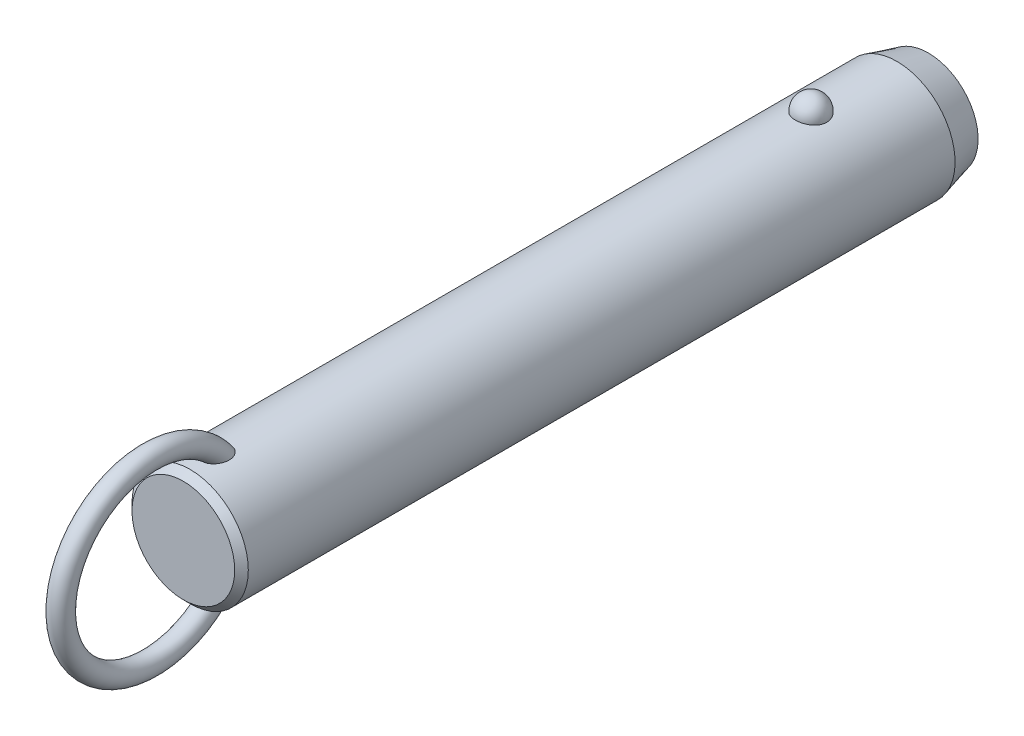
ISO-10303-21;
HEADER;
FILE_DESCRIPTION(('STEP AP214'),'2;1');
FILE_NAME('part.step','',(''),(''),'','','');
FILE_SCHEMA(('AUTOMOTIVE_DESIGN { 1 0 10303 214 1 1 1 1 }'));
ENDSEC;
DATA;
#1=APPLICATION_CONTEXT('core data for automotive mechanical design processes');
#2=APPLICATION_PROTOCOL_DEFINITION('international standard','automotive_design',2000,#1);
#3=PRODUCT_CONTEXT('',#1,'mechanical');
#4=PRODUCT('Part','Part','',(#3));
#5=PRODUCT_RELATED_PRODUCT_CATEGORY('part','',(#4));
#6=PRODUCT_DEFINITION_FORMATION('','',#4);
#7=PRODUCT_DEFINITION_CONTEXT('part definition',#1,'design');
#8=PRODUCT_DEFINITION('design','',#6,#7);
#9=PRODUCT_DEFINITION_SHAPE('','',#8);
#10=(LENGTH_UNIT() NAMED_UNIT(*) SI_UNIT(.MILLI.,.METRE.));
#11=(NAMED_UNIT(*) PLANE_ANGLE_UNIT() SI_UNIT($,.RADIAN.));
#12=(NAMED_UNIT(*) SI_UNIT($,.STERADIAN.) SOLID_ANGLE_UNIT());
#13=UNCERTAINTY_MEASURE_WITH_UNIT(LENGTH_MEASURE(1.E-05),#10,'distance_accuracy_value','');
#14=(GEOMETRIC_REPRESENTATION_CONTEXT(3) GLOBAL_UNCERTAINTY_ASSIGNED_CONTEXT((#13)) GLOBAL_UNIT_ASSIGNED_CONTEXT((#10,
#11,#12)) REPRESENTATION_CONTEXT('',''));
#15=CARTESIAN_POINT('',(0.,0.,0.));
#16=DIRECTION('',(0.,0.,1.));
#17=DIRECTION('',(1.,0.,0.));
#18=AXIS2_PLACEMENT_3D('',#15,#16,#17);
#19=CARTESIAN_POINT('',(0.,0.,104.1));
#20=DIRECTION('',(0.,0.,-1.));
#21=DIRECTION('',(-1.,0.,0.));
#22=AXIS2_PLACEMENT_3D('',#19,#20,#21);
#23=CYLINDRICAL_SURFACE('',#22,11.1);
#24=CARTESIAN_POINT('',(2.9724815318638,10.6945945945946,-3.));
#25=CARTESIAN_POINT('',(2.9724783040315,10.6945972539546,-2.83225059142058));
#26=CARTESIAN_POINT('',(2.95876598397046,10.6984356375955,-2.66445972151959));
#27=CARTESIAN_POINT('',(2.90424529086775,10.7133624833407,-2.33362381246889));
#28=CARTESIAN_POINT('',(2.8634252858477,10.7244540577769,-2.1705808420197));
#29=CARTESIAN_POINT('',(2.75573657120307,10.7526272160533,-1.85396767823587));
#30=CARTESIAN_POINT('',(2.68887937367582,10.7697061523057,-1.70039333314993));
#31=CARTESIAN_POINT('',(2.53079696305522,10.8079438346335,-1.40691598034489));
#32=CARTESIAN_POINT('',(2.43957264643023,10.8291024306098,-1.2670124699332));
#33=CARTESIAN_POINT('',(2.23458150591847,10.8732541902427,-1.00409565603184));
#34=CARTESIAN_POINT('',(2.12071295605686,10.8962553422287,-0.881162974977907));
#35=CARTESIAN_POINT('',(1.87365402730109,10.9414421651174,-0.656352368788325));
#36=CARTESIAN_POINT('',(1.74046358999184,10.9636278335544,-0.554474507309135));
#37=CARTESIAN_POINT('',(1.45872188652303,11.0046495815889,-0.374872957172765));
#38=CARTESIAN_POINT('',(1.31021276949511,11.0234944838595,-0.297085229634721));
#39=CARTESIAN_POINT('',(1.00170030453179,11.0557957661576,-0.167529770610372));
#40=CARTESIAN_POINT('',(0.841698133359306,11.0692526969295,-0.115759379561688));
#41=CARTESIAN_POINT('',(0.517607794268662,11.0890932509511,-0.0403925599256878));
#42=CARTESIAN_POINT('',(0.353633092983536,11.0955916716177,-0.0163383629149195));
#43=CARTESIAN_POINT('',(0.0238420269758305,11.1011989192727,0.00445177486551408));
#44=CARTESIAN_POINT('',(-0.141974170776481,11.1003084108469,0.0011901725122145));
#45=CARTESIAN_POINT('',(-0.46840517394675,11.0912990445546,-0.0323233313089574));
#46=CARTESIAN_POINT('',(-0.629059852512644,11.0832767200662,-0.062214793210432));
#47=CARTESIAN_POINT('',(-0.942937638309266,11.0609962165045,-0.147645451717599));
#48=CARTESIAN_POINT('',(-1.09616062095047,11.0467379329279,-0.203185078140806));
#49=CARTESIAN_POINT('',(-1.39181061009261,11.0134071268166,-0.338752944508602));
#50=CARTESIAN_POINT('',(-1.53417383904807,10.9943086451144,-0.418913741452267));
#51=CARTESIAN_POINT('',(-1.80342160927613,10.9533667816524,-0.601448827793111));
#52=CARTESIAN_POINT('',(-1.9303046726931,10.9315231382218,-0.703825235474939));
#53=CARTESIAN_POINT('',(-2.16747598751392,10.887005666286,-0.930091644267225));
#54=CARTESIAN_POINT('',(-2.27742774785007,10.8643239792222,-1.05433291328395));
#55=CARTESIAN_POINT('',(-2.47517316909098,10.8209886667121,-1.31966633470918));
#56=CARTESIAN_POINT('',(-2.56296538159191,10.8003351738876,-1.46075958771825));
#57=CARTESIAN_POINT('',(-2.71500300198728,10.7631304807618,-1.75753646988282));
#58=CARTESIAN_POINT('',(-2.77898901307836,10.7466250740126,-1.91335887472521));
#59=CARTESIAN_POINT('',(-2.88046189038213,10.7198747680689,-2.2339152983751));
#60=CARTESIAN_POINT('',(-2.91794947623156,10.709629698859,-2.39864907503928));
#61=CARTESIAN_POINT('',(-2.96537819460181,10.6965949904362,-2.73165170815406));
#62=CARTESIAN_POINT('',(-2.97542891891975,10.693775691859,-2.89990378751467));
#63=CARTESIAN_POINT('',(-2.96804271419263,10.6958279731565,-3.235752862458));
#64=CARTESIAN_POINT('',(-2.95060646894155,10.7006993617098,-3.40334987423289));
#65=CARTESIAN_POINT('',(-2.88883358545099,10.71753912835,-3.73233906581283));
#66=CARTESIAN_POINT('',(-2.84462026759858,10.7294749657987,-3.89375610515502));
#67=CARTESIAN_POINT('',(-2.73050447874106,10.7590797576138,-4.20667949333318));
#68=CARTESIAN_POINT('',(-2.66060103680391,10.7767489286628,-4.35818546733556));
#69=CARTESIAN_POINT('',(-2.49642559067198,10.8159599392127,-4.6478542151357));
#70=CARTESIAN_POINT('',(-2.40203047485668,10.8375211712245,-4.78594458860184));
#71=CARTESIAN_POINT('',(-2.19143488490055,10.8820570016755,-5.0441038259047));
#72=CARTESIAN_POINT('',(-2.07523364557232,10.9050316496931,-5.16417205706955));
#73=CARTESIAN_POINT('',(-1.82361254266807,10.9499219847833,-5.38334833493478));
#74=CARTESIAN_POINT('',(-1.68812945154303,10.9718338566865,-5.4823846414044));
#75=CARTESIAN_POINT('',(-1.40191298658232,11.0120611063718,-5.65618873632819));
#76=CARTESIAN_POINT('',(-1.25118062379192,11.0303767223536,-5.73095813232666));
#77=CARTESIAN_POINT('',(-0.940570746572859,11.0611653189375,-5.85334725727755));
#78=CARTESIAN_POINT('',(-0.780821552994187,11.0737044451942,-5.90127578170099));
#79=CARTESIAN_POINT('',(-0.455204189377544,11.0918598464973,-5.96992976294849));
#80=CARTESIAN_POINT('',(-0.289336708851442,11.0974768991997,-5.99065827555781));
#81=CARTESIAN_POINT('',(0.0406846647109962,11.1011307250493,-6.00418773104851));
#82=CARTESIAN_POINT('',(0.204817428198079,11.099299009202,-5.99747318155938));
#83=CARTESIAN_POINT('',(0.529553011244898,11.088551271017,-5.9574031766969));
#84=CARTESIAN_POINT('',(0.690155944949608,11.0796354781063,-5.92404858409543));
#85=CARTESIAN_POINT('',(1.0027760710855,11.0557204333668,-5.83180084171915));
#86=CARTESIAN_POINT('',(1.15482001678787,11.0407414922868,-5.77299291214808));
#87=CARTESIAN_POINT('',(1.44678373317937,11.0062913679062,-5.63147366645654));
#88=CARTESIAN_POINT('',(1.58670279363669,10.9868199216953,-5.54876095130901));
#89=CARTESIAN_POINT('',(1.8527023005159,10.9451315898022,-5.36027644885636));
#90=CARTESIAN_POINT('',(1.97855158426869,10.9228788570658,-5.25418644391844));
#91=CARTESIAN_POINT('',(2.21080872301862,10.8782509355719,-5.02251354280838));
#92=CARTESIAN_POINT('',(2.31721312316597,10.8558757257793,-4.89692718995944));
#93=CARTESIAN_POINT('',(2.50945517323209,10.8130715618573,-4.62745408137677));
#94=CARTESIAN_POINT('',(2.59493284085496,10.7926798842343,-4.48330448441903));
#95=CARTESIAN_POINT('',(2.740862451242,10.7565495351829,-4.18236358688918));
#96=CARTESIAN_POINT('',(2.80132490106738,10.7408089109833,-4.02557762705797));
#97=CARTESIAN_POINT('',(2.88959070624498,10.7173718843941,-3.72475308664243));
#98=CARTESIAN_POINT('',(2.92062102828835,10.7088950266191,-3.58171216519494));
#99=CARTESIAN_POINT('',(2.96206765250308,10.6975052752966,-3.29245795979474));
#100=CARTESIAN_POINT('',(2.97248434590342,10.6945922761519,-3.14624473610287));
#101=CARTESIAN_POINT('',(2.9724815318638,10.6945945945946,-3.));
#102=B_SPLINE_CURVE_WITH_KNOTS('',3,(#24,#25,#26,#27,#28,#29,#30,#31,#32,#33,#34,#35,#36,#37,
#38,#39,#40,#41,#42,#43,#44,#45,#46,#47,#48,#49,#50,#51,#52,#53,#54,#55,#56,#57,#58,#59,#60,#61,
#62,#63,#64,#65,#66,#67,#68,#69,#70,#71,#72,#73,#74,#75,#76,#77,#78,#79,#80,#81,#82,#83,#84,#85,
#86,#87,#88,#89,#90,#91,#92,#93,#94,#95,#96,#97,#98,#99,#100,#101),.UNSPECIFIED.,.T.,.F.,(4,2,2,
2,2,2,2,2,2,2,2,2,2,2,2,2,2,2,2,2,2,2,2,2,2,2,2,2,2,2,2,2,2,2,2,2,2,2,4),(0.,0.502722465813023,
1.00566079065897,1.5083769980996,2.01107471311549,2.51608392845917,3.02109467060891,
3.52475118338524,4.02835620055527,4.52351860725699,5.01863647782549,5.50715297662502,
5.99567766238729,6.48688002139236,6.97812923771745,7.47814366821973,7.97819077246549,
8.48353712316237,8.98886974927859,9.49218093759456,9.99547960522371,10.4964777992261,
10.997494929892,11.5010810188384,12.0046847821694,12.5099796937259,13.0152411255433,
13.5145635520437,14.0138298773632,14.5043200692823,14.9947943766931,15.4836390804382,
15.9725123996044,16.4685040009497,16.9645836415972,17.4686765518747,17.972557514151,
18.410841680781,18.849117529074),.UNSPECIFIED.);
#103=CARTESIAN_POINT('',(2.9724815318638,10.6945945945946,-3.));
#104=VERTEX_POINT('',#103);
#105=EDGE_CURVE('E41',#104,#104,#102,.T.);
#106=ORIENTED_EDGE('',*,*,#105,.T.);
#107=EDGE_LOOP('',(#106));
#108=FACE_BOUND('',#107,.T.);
#109=CARTESIAN_POINT('',(0.,0.,115.5));
#110=DIRECTION('',(0.,0.,1.));
#111=DIRECTION('',(1.,0.,0.));
#112=AXIS2_PLACEMENT_3D('',#109,#110,#111);
#113=CIRCLE('',#112,11.1);
#114=CARTESIAN_POINT('',(11.1,0.,115.5));
#115=VERTEX_POINT('',#114);
#116=EDGE_CURVE('E10',#115,#115,#113,.F.);
#117=ORIENTED_EDGE('',*,*,#116,.T.);
#118=EDGE_LOOP('',(#117));
#119=FACE_BOUND('',#118,.T.);
#120=CARTESIAN_POINT('',(-0.564520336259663,-11.0856356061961,107.757815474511));
#121=CARTESIAN_POINT('',(-0.667202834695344,-11.0804062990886,107.791283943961));
#122=CARTESIAN_POINT('',(-0.766875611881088,-11.0738877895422,107.833835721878));
#123=CARTESIAN_POINT('',(-0.957284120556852,-11.0590576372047,107.935419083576));
#124=CARTESIAN_POINT('',(-1.04801616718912,-11.0507452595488,107.99445742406));
#125=CARTESIAN_POINT('',(-1.21800952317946,-11.0333016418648,108.126529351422));
#126=CARTESIAN_POINT('',(-1.29730805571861,-11.0241732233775,108.199515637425));
#127=CARTESIAN_POINT('',(-1.44337665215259,-11.0060026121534,108.357037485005));
#128=CARTESIAN_POINT('',(-1.51014622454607,-10.9969604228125,108.441573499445));
#129=CARTESIAN_POINT('',(-1.63454620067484,-10.9791841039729,108.625521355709));
#130=CARTESIAN_POINT('',(-1.69127003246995,-10.9705107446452,108.725549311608));
#131=CARTESIAN_POINT('',(-1.78980785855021,-10.9548648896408,108.932790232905));
#132=CARTESIAN_POINT('',(-1.83161214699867,-10.9478935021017,109.040007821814));
#133=CARTESIAN_POINT('',(-1.91557028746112,-10.9335803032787,109.305408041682));
#134=CARTESIAN_POINT('',(-1.95040620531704,-10.9273269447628,109.465980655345));
#135=CARTESIAN_POINT('',(-1.99388326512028,-10.9194709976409,109.790697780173));
#136=CARTESIAN_POINT('',(-2.00248051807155,-10.9178762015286,109.954847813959));
#137=CARTESIAN_POINT('',(-1.99551615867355,-10.9191578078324,110.324650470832));
#138=CARTESIAN_POINT('',(-1.9732206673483,-10.9232807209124,110.530191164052));
#139=CARTESIAN_POINT('',(-1.91529761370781,-10.9335244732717,110.833595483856));
#140=CARTESIAN_POINT('',(-1.8918457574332,-10.9376266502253,110.934088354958));
#141=CARTESIAN_POINT('',(-1.83700674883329,-10.9469720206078,111.132855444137));
#142=CARTESIAN_POINT('',(-1.80562070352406,-10.9522150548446,111.231129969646));
#143=CARTESIAN_POINT('',(-1.73463055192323,-10.9636837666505,111.425914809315));
#144=CARTESIAN_POINT('',(-1.69493416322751,-10.9699202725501,111.522390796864));
#145=CARTESIAN_POINT('',(-1.60745141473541,-10.9830806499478,111.711626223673));
#146=CARTESIAN_POINT('',(-1.55966150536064,-10.9900048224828,111.804384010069));
#147=CARTESIAN_POINT('',(-1.45591812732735,-11.0042280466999,111.984690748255));
#148=CARTESIAN_POINT('',(-1.40000013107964,-11.0115253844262,112.072260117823));
#149=CARTESIAN_POINT('',(-1.27937470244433,-11.0261911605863,112.241029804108));
#150=CARTESIAN_POINT('',(-1.21467835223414,-11.0335594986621,112.32223795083));
#151=CARTESIAN_POINT('',(-1.08218150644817,-11.0473027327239,112.469001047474));
#152=CARTESIAN_POINT('',(-1.01522633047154,-11.0537063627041,112.535309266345));
#153=CARTESIAN_POINT('',(-0.872952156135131,-11.065850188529,112.658378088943));
#154=CARTESIAN_POINT('',(-0.797642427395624,-11.0715911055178,112.715149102));
#155=CARTESIAN_POINT('',(-0.651396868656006,-11.081071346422,112.807515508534));
#156=CARTESIAN_POINT('',(-0.581712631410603,-11.0849841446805,112.845049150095));
#157=CARTESIAN_POINT('',(-0.437066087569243,-11.0916271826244,112.908259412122));
#158=CARTESIAN_POINT('',(-0.362109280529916,-11.0943586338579,112.933948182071));
#159=CARTESIAN_POINT('',(-0.207828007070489,-11.0983242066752,112.971117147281));
#160=CARTESIAN_POINT('',(-0.128467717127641,-11.0995432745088,112.982454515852));
#161=CARTESIAN_POINT('',(0.0309101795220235,-11.1002423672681,112.988965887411));
#162=CARTESIAN_POINT('',(0.110927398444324,-11.0997233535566,112.984148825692));
#163=CARTESIAN_POINT('',(0.256406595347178,-11.097240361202,112.960959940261));
#164=CARTESIAN_POINT('',(0.32223577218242,-11.0955074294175,112.944754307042));
#165=CARTESIAN_POINT('',(0.450635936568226,-11.0910350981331,112.902600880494));
#166=CARTESIAN_POINT('',(0.513205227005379,-11.0882951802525,112.876648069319));
#167=CARTESIAN_POINT('',(0.662626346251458,-11.0805620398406,112.802607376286));
#168=CARTESIAN_POINT('',(0.747127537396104,-11.0751144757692,112.749845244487));
#169=CARTESIAN_POINT('',(0.906756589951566,-11.0631932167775,112.631720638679));
#170=CARTESIAN_POINT('',(0.981859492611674,-11.0567168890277,112.566325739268));
#171=CARTESIAN_POINT('',(1.10712207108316,-11.0447856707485,112.44226337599));
#172=CARTESIAN_POINT('',(1.15909566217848,-11.0394280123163,112.385383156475));
#173=CARTESIAN_POINT('',(1.25791923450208,-11.0286040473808,112.267327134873));
#174=CARTESIAN_POINT('',(1.30476642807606,-11.0231376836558,112.206149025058));
#175=CARTESIAN_POINT('',(1.43818612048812,-11.0068027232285,112.017305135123));
#176=CARTESIAN_POINT('',(1.51751767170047,-10.9960104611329,111.884453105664));
#177=CARTESIAN_POINT('',(1.63597546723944,-10.9788847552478,111.653137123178));
#178=CARTESIAN_POINT('',(1.67988876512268,-10.9722190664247,111.557053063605));
#179=CARTESIAN_POINT('',(1.75953241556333,-10.9597298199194,111.361431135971));
#180=CARTESIAN_POINT('',(1.79525967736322,-10.9539065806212,111.261891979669));
#181=CARTESIAN_POINT('',(1.85844731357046,-10.9433632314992,111.06021118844));
#182=CARTESIAN_POINT('',(1.88591073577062,-10.9386427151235,110.95807052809));
#183=CARTESIAN_POINT('',(1.93234324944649,-10.9305350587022,110.751819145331));
#184=CARTESIAN_POINT('',(1.95131065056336,-10.9271481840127,110.647708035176));
#185=CARTESIAN_POINT('',(1.99040203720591,-10.9201183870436,110.365458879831));
#186=CARTESIAN_POINT('',(2.00221217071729,-10.9179256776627,110.186037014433));
#187=CARTESIAN_POINT('',(1.99711676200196,-10.9188636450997,109.827713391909));
#188=CARTESIAN_POINT('',(1.98026150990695,-10.9219849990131,109.648811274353));
#189=CARTESIAN_POINT('',(1.92151657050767,-10.9324473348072,109.33645144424));
#190=CARTESIAN_POINT('',(1.88605081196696,-10.9386915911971,109.201759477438));
#191=CARTESIAN_POINT('',(1.7939302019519,-10.9541780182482,108.939966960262));
#192=CARTESIAN_POINT('',(1.73729868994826,-10.9634168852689,108.812858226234));
#193=CARTESIAN_POINT('',(1.612370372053,-10.9824218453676,108.589418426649));
#194=CARTESIAN_POINT('',(1.54715374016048,-10.9918945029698,108.491345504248));
#195=CARTESIAN_POINT('',(1.40127026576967,-11.0114415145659,108.307434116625));
#196=CARTESIAN_POINT('',(1.32060742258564,-11.0215157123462,108.221592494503));
#197=CARTESIAN_POINT('',(1.14474787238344,-11.041168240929,108.065163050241));
#198=CARTESIAN_POINT('',(1.04947805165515,-11.0507437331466,107.994656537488));
#199=CARTESIAN_POINT('',(0.847278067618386,-11.0680789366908,107.872640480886));
#200=CARTESIAN_POINT('',(0.74035174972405,-11.0758392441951,107.821124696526));
#201=CARTESIAN_POINT('',(0.52928931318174,-11.0878275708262,107.743485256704));
#202=CARTESIAN_POINT('',(0.425895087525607,-11.0923259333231,107.715377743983));
#203=CARTESIAN_POINT('',(0.215723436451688,-11.0984001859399,107.677703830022));
#204=CARTESIAN_POINT('',(0.108947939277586,-11.0999777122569,107.668127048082));
#205=CARTESIAN_POINT('',(-0.0938962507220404,-11.1000196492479,107.667877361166));
#206=CARTESIAN_POINT('',(-0.189967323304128,-11.0987797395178,107.675408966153));
#207=CARTESIAN_POINT('',(-0.379657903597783,-11.0939111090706,107.705507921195));
#208=CARTESIAN_POINT('',(-0.473277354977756,-11.0902823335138,107.728075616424));
#209=CARTESIAN_POINT('',(-0.564520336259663,-11.0856356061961,107.757815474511));
#210=B_SPLINE_CURVE_WITH_KNOTS('',3,(#120,#121,#122,#123,#124,#125,#126,#127,#128,#129,#130,
#131,#132,#133,#134,#135,#136,#137,#138,#139,#140,#141,#142,#143,#144,#145,#146,#147,#148,#149,
#150,#151,#152,#153,#154,#155,#156,#157,#158,#159,#160,#161,#162,#163,#164,#165,#166,#167,#168,
#169,#170,#171,#172,#173,#174,#175,#176,#177,#178,#179,#180,#181,#182,#183,#184,#185,#186,#187,
#188,#189,#190,#191,#192,#193,#194,#195,#196,#197,#198,#199,#200,#201,#202,#203,#204,#205,#206,
#207,#208,#209),.UNSPECIFIED.,.T.,.F.,(4,2,2,2,2,2,2,2,2,2,2,2,2,2,2,2,2,2,2,2,2,2,2,2,2,2,2,2,
2,2,2,2,2,2,2,2,2,2,2,2,2,2,2,2,4),(0.,0.323999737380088,0.648132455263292,0.971184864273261,
1.29424994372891,1.63886237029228,1.98369857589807,2.47426059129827,2.96564271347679,
3.58257396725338,3.89215258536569,4.20168803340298,4.51486273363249,4.82817514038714,
5.14015911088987,5.45175282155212,5.73442856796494,6.01679375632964,6.25364580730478,
6.49025437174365,6.7291996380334,6.96801276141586,7.17061258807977,7.37331685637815,
7.67094989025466,7.96935728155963,8.2007506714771,8.43226927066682,8.89581623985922,
9.21306533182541,9.53043400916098,9.84768549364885,10.1650000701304,10.70229304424,
11.2386443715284,11.6553390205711,12.0715755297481,12.4245637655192,12.7774607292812,
13.1321855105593,13.4867936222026,13.8068771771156,14.1267813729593,14.4146787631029,
14.7025827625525),.UNSPECIFIED.);
#211=CARTESIAN_POINT('',(-0.564520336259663,-11.0856356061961,107.757815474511));
#212=VERTEX_POINT('',#211);
#213=EDGE_CURVE('E59',#212,#212,#210,.T.);
#214=ORIENTED_EDGE('',*,*,#213,.T.);
#215=EDGE_LOOP('',(#214));
#216=FACE_BOUND('',#215,.T.);
#217=CARTESIAN_POINT('',(-0.564520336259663,11.0856356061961,107.757815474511));
#218=CARTESIAN_POINT('',(-0.468542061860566,11.0905203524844,107.726545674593));
#219=CARTESIAN_POINT('',(-0.36979381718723,11.0942886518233,107.703157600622));
#220=CARTESIAN_POINT('',(-0.169555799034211,11.0991586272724,107.673085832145));
#221=CARTESIAN_POINT('',(-0.0680604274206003,11.1002543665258,107.66643932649));
#222=CARTESIAN_POINT('',(0.134549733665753,11.099646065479,107.670157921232));
#223=CARTESIAN_POINT('',(0.235664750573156,11.0979441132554,107.68051033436));
#224=CARTESIAN_POINT('',(0.43463240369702,11.0919342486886,107.717831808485));
#225=CARTESIAN_POINT('',(0.532486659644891,11.0876276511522,107.744792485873));
#226=CARTESIAN_POINT('',(0.722445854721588,11.0768742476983,107.8144096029));
#227=CARTESIAN_POINT('',(0.814543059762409,11.0704246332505,107.857086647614));
#228=CARTESIAN_POINT('',(0.99056508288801,11.0560659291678,107.956648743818));
#229=CARTESIAN_POINT('',(1.07448844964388,11.048156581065,108.013536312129));
#230=CARTESIAN_POINT('',(1.23562672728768,11.0313221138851,108.142210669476));
#231=CARTESIAN_POINT('',(1.31242684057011,11.0223686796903,108.214511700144));
#232=CARTESIAN_POINT('',(1.45398030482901,11.0045918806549,108.370042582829));
#233=CARTESIAN_POINT('',(1.51873073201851,10.9957685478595,108.453275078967));
#234=CARTESIAN_POINT('',(1.64107232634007,10.9782087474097,108.636384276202));
#235=CARTESIAN_POINT('',(1.69743176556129,10.9695572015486,108.737089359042));
#236=CARTESIAN_POINT('',(1.79515063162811,10.9539887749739,108.945626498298));
#237=CARTESIAN_POINT('',(1.83649966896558,10.9470730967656,109.05346343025));
#238=CARTESIAN_POINT('',(1.91931148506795,10.9329211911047,109.320399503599));
#239=CARTESIAN_POINT('',(1.9534010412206,10.9267904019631,109.481861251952));
#240=CARTESIAN_POINT('',(1.99526195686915,10.9192174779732,109.80821631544));
#241=CARTESIAN_POINT('',(2.00298989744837,10.9177830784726,109.97311484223));
#242=CARTESIAN_POINT('',(1.99396251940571,10.9194420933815,110.344100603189));
#243=CARTESIAN_POINT('',(1.97050829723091,10.923774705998,110.55003871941));
#244=CARTESIAN_POINT('',(1.91079643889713,10.9343131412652,110.853901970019));
#245=CARTESIAN_POINT('',(1.88673702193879,10.9385106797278,110.954529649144));
#246=CARTESIAN_POINT('',(1.83065508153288,10.9480376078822,111.153510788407));
#247=CARTESIAN_POINT('',(1.79863369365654,10.9533668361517,111.251864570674));
#248=CARTESIAN_POINT('',(1.72633365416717,10.9649954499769,111.446720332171));
#249=CARTESIAN_POINT('',(1.68596409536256,10.9713053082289,111.54318790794));
#250=CARTESIAN_POINT('',(1.59707998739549,10.9845964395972,111.732323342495));
#251=CARTESIAN_POINT('',(1.54856169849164,10.9915780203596,111.824989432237));
#252=CARTESIAN_POINT('',(1.44330168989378,11.0058935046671,112.004975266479));
#253=CARTESIAN_POINT('',(1.38659749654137,11.0132257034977,112.092316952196));
#254=CARTESIAN_POINT('',(1.26431158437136,11.0279330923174,112.260456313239));
#255=CARTESIAN_POINT('',(1.19874160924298,11.0353082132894,112.341262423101));
#256=CARTESIAN_POINT('',(1.06542088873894,11.048931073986,112.485985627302));
#257=CARTESIAN_POINT('',(0.998640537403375,11.0552153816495,112.550784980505));
#258=CARTESIAN_POINT('',(0.856896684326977,11.0671032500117,112.670846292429));
#259=CARTESIAN_POINT('',(0.781942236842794,11.0727075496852,112.726118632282));
#260=CARTESIAN_POINT('',(0.636276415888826,11.081949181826,112.815972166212));
#261=CARTESIAN_POINT('',(0.566755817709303,11.0857572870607,112.852441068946));
#262=CARTESIAN_POINT('',(0.422602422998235,11.0921860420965,112.913533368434));
#263=CARTESIAN_POINT('',(0.347974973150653,11.0948079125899,112.938168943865));
#264=CARTESIAN_POINT('',(0.194593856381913,11.0985608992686,112.973323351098));
#265=CARTESIAN_POINT('',(0.115807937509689,11.0996777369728,112.983706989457));
#266=CARTESIAN_POINT('',(-0.0422499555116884,11.1002003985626,112.988574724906));
#267=CARTESIAN_POINT('',(-0.121521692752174,11.09960699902,112.983066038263));
#268=CARTESIAN_POINT('',(-0.266046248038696,11.0970123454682,112.958827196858));
#269=CARTESIAN_POINT('',(-0.331661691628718,11.0952283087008,112.942135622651));
#270=CARTESIAN_POINT('',(-0.459588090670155,11.0906663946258,112.899111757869));
#271=CARTESIAN_POINT('',(-0.521897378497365,11.0878880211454,112.872774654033));
#272=CARTESIAN_POINT('',(-0.671446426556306,11.0800342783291,112.797513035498));
#273=CARTESIAN_POINT('',(-0.756250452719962,11.0744969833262,112.743818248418));
#274=CARTESIAN_POINT('',(-0.916349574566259,11.0624045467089,112.623802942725));
#275=CARTESIAN_POINT('',(-0.99161892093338,11.0558467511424,112.557449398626));
#276=CARTESIAN_POINT('',(-1.11713140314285,11.0437783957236,112.431633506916));
#277=CARTESIAN_POINT('',(-1.16920539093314,11.0383619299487,112.373952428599));
#278=CARTESIAN_POINT('',(-1.26817476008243,11.02743010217,112.254280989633));
#279=CARTESIAN_POINT('',(-1.31506731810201,11.0219146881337,112.192288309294));
#280=CARTESIAN_POINT('',(-1.40399813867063,11.0109399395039,112.064784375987));
#281=CARTESIAN_POINT('',(-1.4460286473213,11.0054807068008,111.999267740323));
#282=CARTESIAN_POINT('',(-1.52538779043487,10.9947621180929,111.865422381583));
#283=CARTESIAN_POINT('',(-1.56271516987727,10.9895028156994,111.797092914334));
#284=CARTESIAN_POINT('',(-1.64537943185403,10.9774790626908,111.633210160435));
#285=CARTESIAN_POINT('',(-1.68879497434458,10.9708503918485,111.5366735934));
#286=CARTESIAN_POINT('',(-1.76740738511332,10.9584602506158,111.340236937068));
#287=CARTESIAN_POINT('',(-1.80260120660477,10.95269910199,111.24033561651));
#288=CARTESIAN_POINT('',(-1.86468657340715,10.9423003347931,111.037966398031));
#289=CARTESIAN_POINT('',(-1.89158164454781,10.9376622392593,110.935499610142));
#290=CARTESIAN_POINT('',(-1.93682458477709,10.9297405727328,110.728642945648));
#291=CARTESIAN_POINT('',(-1.9551708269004,10.9264572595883,110.624252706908));
#292=CARTESIAN_POINT('',(-1.99232562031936,10.9197647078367,110.34262876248));
#293=CARTESIAN_POINT('',(-2.00294603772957,10.9177914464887,110.164185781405));
#294=CARTESIAN_POINT('',(-1.99566675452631,10.9191290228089,109.807996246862));
#295=CARTESIAN_POINT('',(-1.97781651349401,10.9224306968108,109.63024902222));
#296=CARTESIAN_POINT('',(-1.91747214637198,10.9331592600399,109.319792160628));
#297=CARTESIAN_POINT('',(-1.88131022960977,10.9395108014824,109.185825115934));
#298=CARTESIAN_POINT('',(-1.7879038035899,10.9551659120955,108.92559757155));
#299=CARTESIAN_POINT('',(-1.7306830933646,10.9644661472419,108.799328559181));
#300=CARTESIAN_POINT('',(-1.60475573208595,10.9835398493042,108.57741565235));
#301=CARTESIAN_POINT('',(-1.53908879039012,10.9930297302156,108.480026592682));
#302=CARTESIAN_POINT('',(-1.39238608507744,11.0125708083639,108.297525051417));
#303=CARTESIAN_POINT('',(-1.31135150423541,11.0226219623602,108.212411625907));
#304=CARTESIAN_POINT('',(-1.14382035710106,11.0411991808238,108.06529943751));
#305=CARTESIAN_POINT('',(-1.05858500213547,11.0497792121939,108.00186930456));
#306=CARTESIAN_POINT('',(-0.878723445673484,11.0655285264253,107.890250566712));
#307=CARTESIAN_POINT('',(-0.784123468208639,11.0727015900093,107.842020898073));
#308=CARTESIAN_POINT('',(-0.646163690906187,11.0812501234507,107.786023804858));
#309=CARTESIAN_POINT('',(-0.605595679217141,11.0835451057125,107.771197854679));
#310=CARTESIAN_POINT('',(-0.564520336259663,11.0856356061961,107.757815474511));
#311=B_SPLINE_CURVE_WITH_KNOTS('',3,(#217,#218,#219,#220,#221,#222,#223,#224,#225,#226,#227,
#228,#229,#230,#231,#232,#233,#234,#235,#236,#237,#238,#239,#240,#241,#242,#243,#244,#245,#246,
#247,#248,#249,#250,#251,#252,#253,#254,#255,#256,#257,#258,#259,#260,#261,#262,#263,#264,#265,
#266,#267,#268,#269,#270,#271,#272,#273,#274,#275,#276,#277,#278,#279,#280,#281,#282,#283,#284,
#285,#286,#287,#288,#289,#290,#291,#292,#293,#294,#295,#296,#297,#298,#299,#300,#301,#302,#303,
#304,#305,#306,#307,#308,#309,#310),.UNSPECIFIED.,.T.,.F.,(4,2,2,2,2,2,2,2,2,2,2,2,2,2,2,2,2,2,
2,2,2,2,2,2,2,2,2,2,2,2,2,2,2,2,2,2,2,2,2,2,2,2,2,2,2,2,4),(0.,0.303061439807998,
0.606795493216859,0.910302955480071,1.21365733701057,1.51741085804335,1.82121821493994,
2.13745205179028,2.45376252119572,2.79958678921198,3.14564996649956,3.63832391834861,
4.13180893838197,4.75031912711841,5.06071926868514,5.37107516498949,5.68500772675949,
5.99908475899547,6.31176519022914,6.62403542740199,6.90315673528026,7.1819719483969,
7.41687778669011,7.65154134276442,7.88841587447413,8.12518286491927,8.3275284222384,
8.52997509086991,8.82986421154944,9.13054668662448,9.36393502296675,9.59744991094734,
9.83133221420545,10.0652767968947,10.383032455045,10.7009056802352,11.0186436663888,
11.3364420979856,11.8705925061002,12.4038159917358,12.8189662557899,13.2336487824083,
13.5857049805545,13.9377340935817,14.2561354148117,14.5736690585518,14.7033687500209),.UNSPECIFIED.);
#312=CARTESIAN_POINT('',(-0.564520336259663,11.0856356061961,107.757815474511));
#313=VERTEX_POINT('',#312);
#314=EDGE_CURVE('E67',#313,#313,#311,.T.);
#315=ORIENTED_EDGE('',*,*,#314,.T.);
#316=EDGE_LOOP('',(#315));
#317=FACE_BOUND('',#316,.T.);
#318=CARTESIAN_POINT('',(0.,0.,-19.3999999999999));
#319=DIRECTION('',(0.,0.,-1.));
#320=DIRECTION('',(-1.,0.,0.));
#321=AXIS2_PLACEMENT_3D('',#318,#319,#320);
#322=CIRCLE('',#321,11.1);
#323=CARTESIAN_POINT('',(-11.1,0.,-19.3999999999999));
#324=VERTEX_POINT('',#323);
#325=EDGE_CURVE('E56',#324,#324,#322,.F.);
#326=ORIENTED_EDGE('',*,*,#325,.T.);
#327=EDGE_LOOP('',(#326));
#328=FACE_BOUND('',#327,.T.);
#329=ADVANCED_FACE('F37',(#108,#119,#216,#317,#328),#23,.T.);
#330=CARTESIAN_POINT('',(0.,0.,-25.4));
#331=DIRECTION('',(0.,0.,-1.));
#332=DIRECTION('',(-1.,0.,0.));
#333=AXIS2_PLACEMENT_3D('',#330,#331,#332);
#334=PLANE('',#333);
#335=CARTESIAN_POINT('',(0.,0.,-25.4));
#336=DIRECTION('',(0.,0.,-1.));
#337=DIRECTION('',(-1.,0.,0.));
#338=AXIS2_PLACEMENT_3D('',#335,#336,#337);
#339=CIRCLE('',#338,9.49230484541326);
#340=CARTESIAN_POINT('',(-9.49230484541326,0.,-25.4));
#341=VERTEX_POINT('',#340);
#342=EDGE_CURVE('E66',#341,#341,#339,.T.);
#343=ORIENTED_EDGE('',*,*,#342,.T.);
#344=EDGE_LOOP('',(#343));
#345=FACE_BOUND('',#344,.T.);
#346=ADVANCED_FACE('F85',(#345),#334,.T.);
#347=CARTESIAN_POINT('',(0.,0.,-25.4));
#348=DIRECTION('',(0.,0.,1.));
#349=DIRECTION('',(1.,0.,0.));
#350=AXIS2_PLACEMENT_3D('',#347,#348,#349);
#351=CONICAL_SURFACE('',#350,9.49230484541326,0.261799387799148);
#352=ORIENTED_EDGE('',*,*,#325,.F.);
#353=EDGE_LOOP('',(#352));
#354=FACE_BOUND('',#353,.T.);
#355=ORIENTED_EDGE('',*,*,#342,.F.);
#356=EDGE_LOOP('',(#355));
#357=FACE_BOUND('',#356,.T.);
#358=ADVANCED_FACE('F83',(#354,#357),#351,.T.);
#359=CARTESIAN_POINT('',(0.,0.,116.8));
#360=DIRECTION('',(0.,0.,1.));
#361=DIRECTION('',(1.,0.,0.));
#362=AXIS2_PLACEMENT_3D('',#359,#360,#361);
#363=PLANE('',#362);
#364=CARTESIAN_POINT('',(0.,0.,116.8));
#365=DIRECTION('',(0.,0.,1.));
#366=DIRECTION('',(1.,0.,0.));
#367=AXIS2_PLACEMENT_3D('',#364,#365,#366);
#368=CIRCLE('',#367,9.79999999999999);
#369=CARTESIAN_POINT('',(9.79999999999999,0.,116.8));
#370=VERTEX_POINT('',#369);
#371=EDGE_CURVE('E50',#370,#370,#368,.T.);
#372=ORIENTED_EDGE('',*,*,#371,.T.);
#373=EDGE_LOOP('',(#372));
#374=FACE_BOUND('',#373,.T.);
#375=ADVANCED_FACE('F77',(#374),#363,.T.);
#376=CARTESIAN_POINT('',(0.,0.,123.15));
#377=DIRECTION('',(1.,0.,0.));
#378=DIRECTION('',(0.,0.,-1.));
#379=AXIS2_PLACEMENT_3D('',#376,#377,#378);
#380=TOROIDAL_SURFACE('',#379,17.05,2.);
#381=ORIENTED_EDGE('',*,*,#314,.F.);
#382=EDGE_LOOP('',(#381));
#383=FACE_BOUND('',#382,.T.);
#384=ORIENTED_EDGE('',*,*,#213,.F.);
#385=EDGE_LOOP('',(#384));
#386=FACE_BOUND('',#385,.T.);
#387=ADVANCED_FACE('F73',(#383,#386),#380,.T.);
#388=CARTESIAN_POINT('',(0.,0.,116.8));
#389=DIRECTION('',(0.,0.,-1.));
#390=DIRECTION('',(-1.,0.,0.));
#391=AXIS2_PLACEMENT_3D('',#388,#389,#390);
#392=CONICAL_SURFACE('',#391,9.79999999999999,0.785398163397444);
#393=ORIENTED_EDGE('',*,*,#116,.F.);
#394=EDGE_LOOP('',(#393));
#395=FACE_BOUND('',#394,.T.);
#396=ORIENTED_EDGE('',*,*,#371,.F.);
#397=EDGE_LOOP('',(#396));
#398=FACE_BOUND('',#397,.T.);
#399=ADVANCED_FACE('F39',(#395,#398),#392,.T.);
#400=CARTESIAN_POINT('',(0.,11.1,-3.));
#401=DIRECTION('',(0.,1.,0.));
#402=DIRECTION('',(0.,0.,-1.));
#403=AXIS2_PLACEMENT_3D('',#400,#401,#402);
#404=SPHERICAL_SURFACE('',#403,3.);
#405=ORIENTED_EDGE('',*,*,#105,.F.);
#406=EDGE_LOOP('',(#405));
#407=FACE_BOUND('',#406,.T.);
#408=ADVANCED_FACE('F79',(#407),#404,.T.);
#409=CLOSED_SHELL('',(#329,#346,#358,#375,#387,#399,#408));
#410=MANIFOLD_SOLID_BREP('B2',#409);
#411=ADVANCED_BREP_SHAPE_REPRESENTATION('',(#18,#410),#14);
#412=SHAPE_DEFINITION_REPRESENTATION(#9,#411);
ENDSEC;
END-ISO-10303-21;
